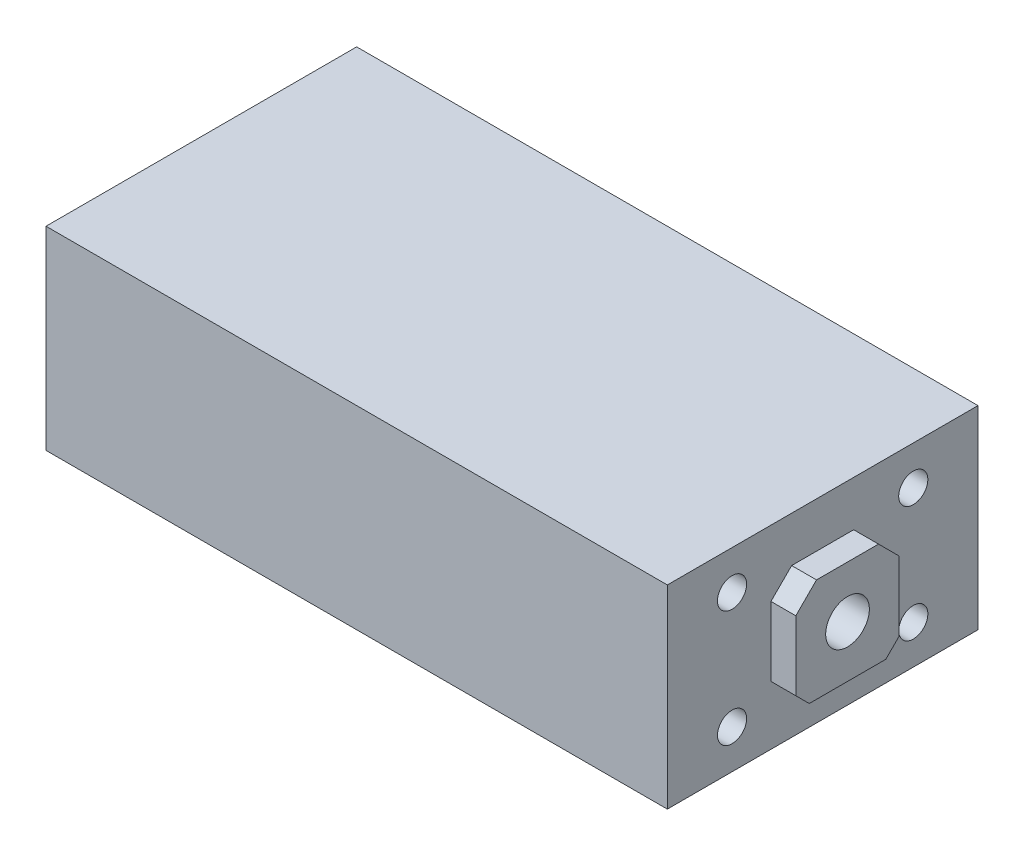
ISO-10303-21;
HEADER;
FILE_DESCRIPTION(('STEP AP214'),'2;1');
FILE_NAME('part.step','',(''),(''),'','','');
FILE_SCHEMA(('AUTOMOTIVE_DESIGN { 1 0 10303 214 1 1 1 1 }'));
ENDSEC;
DATA;
#1=APPLICATION_CONTEXT('core data for automotive mechanical design processes');
#2=APPLICATION_PROTOCOL_DEFINITION('international standard','automotive_design',2000,#1);
#3=PRODUCT_CONTEXT('',#1,'mechanical');
#4=PRODUCT('Part','Part','',(#3));
#5=PRODUCT_RELATED_PRODUCT_CATEGORY('part','',(#4));
#6=PRODUCT_DEFINITION_FORMATION('','',#4);
#7=PRODUCT_DEFINITION_CONTEXT('part definition',#1,'design');
#8=PRODUCT_DEFINITION('design','',#6,#7);
#9=PRODUCT_DEFINITION_SHAPE('','',#8);
#10=(LENGTH_UNIT() NAMED_UNIT(*) SI_UNIT(.MILLI.,.METRE.));
#11=(NAMED_UNIT(*) PLANE_ANGLE_UNIT() SI_UNIT($,.RADIAN.));
#12=(NAMED_UNIT(*) SI_UNIT($,.STERADIAN.) SOLID_ANGLE_UNIT());
#13=UNCERTAINTY_MEASURE_WITH_UNIT(LENGTH_MEASURE(1.E-05),#10,'distance_accuracy_value','');
#14=(GEOMETRIC_REPRESENTATION_CONTEXT(3) GLOBAL_UNCERTAINTY_ASSIGNED_CONTEXT((#13)) GLOBAL_UNIT_ASSIGNED_CONTEXT((#10,
#11,#12)) REPRESENTATION_CONTEXT('',''));
#15=CARTESIAN_POINT('',(0.,0.,0.));
#16=DIRECTION('',(0.,0.,1.));
#17=DIRECTION('',(1.,0.,0.));
#18=AXIS2_PLACEMENT_3D('',#15,#16,#17);
#19=CARTESIAN_POINT('',(0.,23.8125,-38.1));
#20=DIRECTION('',(-1.,0.,0.));
#21=DIRECTION('',(0.,0.,1.));
#22=AXIS2_PLACEMENT_3D('',#19,#20,#21);
#23=PLANE('',#22);
#24=CARTESIAN_POINT('',(0.,14.2748,22.225));
#25=DIRECTION('',(1.,0.,0.));
#26=DIRECTION('',(0.,0.,-1.));
#27=AXIS2_PLACEMENT_3D('',#24,#25,#26);
#28=CIRCLE('',#27,3.57187499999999);
#29=CARTESIAN_POINT('',(0.,14.2748,18.653125));
#30=VERTEX_POINT('',#29);
#31=EDGE_CURVE('E144',#30,#30,#28,.T.);
#32=ORIENTED_EDGE('',*,*,#31,.F.);
#33=EDGE_LOOP('',(#32));
#34=FACE_BOUND('',#33,.T.);
#35=CARTESIAN_POINT('',(0.,-14.2748,22.225));
#36=DIRECTION('',(1.,0.,0.));
#37=DIRECTION('',(0.,0.,-1.));
#38=AXIS2_PLACEMENT_3D('',#35,#36,#37);
#39=CIRCLE('',#38,3.57187499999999);
#40=CARTESIAN_POINT('',(0.,-14.2748,18.653125));
#41=VERTEX_POINT('',#40);
#42=EDGE_CURVE('E155',#41,#41,#39,.T.);
#43=ORIENTED_EDGE('',*,*,#42,.F.);
#44=EDGE_LOOP('',(#43));
#45=FACE_BOUND('',#44,.T.);
#46=CARTESIAN_POINT('',(0.,-14.2748,-22.225));
#47=DIRECTION('',(1.,0.,0.));
#48=DIRECTION('',(0.,0.,-1.));
#49=AXIS2_PLACEMENT_3D('',#46,#47,#48);
#50=CIRCLE('',#49,3.57187499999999);
#51=CARTESIAN_POINT('',(0.,-14.2748,-25.796875));
#52=VERTEX_POINT('',#51);
#53=EDGE_CURVE('E161',#52,#52,#50,.T.);
#54=ORIENTED_EDGE('',*,*,#53,.F.);
#55=EDGE_LOOP('',(#54));
#56=FACE_BOUND('',#55,.T.);
#57=CARTESIAN_POINT('',(0.,14.2748,-22.225));
#58=DIRECTION('',(1.,0.,0.));
#59=DIRECTION('',(0.,0.,-1.));
#60=AXIS2_PLACEMENT_3D('',#57,#58,#59);
#61=CIRCLE('',#60,3.57187499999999);
#62=CARTESIAN_POINT('',(0.,14.2748,-25.796875));
#63=VERTEX_POINT('',#62);
#64=EDGE_CURVE('E167',#63,#63,#61,.T.);
#65=ORIENTED_EDGE('',*,*,#64,.F.);
#66=EDGE_LOOP('',(#65));
#67=FACE_BOUND('',#66,.T.);
#68=DIRECTION('',(0.,1.,0.));
#69=VECTOR('',#68,1.);
#70=CARTESIAN_POINT('',(0.,-23.8125,-38.1));
#71=LINE('',#70,#69);
#72=CARTESIAN_POINT('',(0.,-23.8125,-38.1));
#73=VERTEX_POINT('',#72);
#74=CARTESIAN_POINT('',(0.,23.8125,-38.1));
#75=VERTEX_POINT('',#74);
#76=EDGE_CURVE('E234',#73,#75,#71,.T.);
#77=ORIENTED_EDGE('',*,*,#76,.T.);
#78=DIRECTION('',(0.,0.,1.));
#79=VECTOR('',#78,1.);
#80=CARTESIAN_POINT('',(0.,23.8125,38.1));
#81=LINE('',#80,#79);
#82=CARTESIAN_POINT('',(0.,23.8125,38.1));
#83=VERTEX_POINT('',#82);
#84=EDGE_CURVE('E250',#75,#83,#81,.T.);
#85=ORIENTED_EDGE('',*,*,#84,.T.);
#86=DIRECTION('',(0.,-1.,0.));
#87=VECTOR('',#86,1.);
#88=CARTESIAN_POINT('',(0.,-23.8125,38.1));
#89=LINE('',#88,#87);
#90=CARTESIAN_POINT('',(0.,-23.8125,38.1));
#91=VERTEX_POINT('',#90);
#92=EDGE_CURVE('E253',#83,#91,#89,.T.);
#93=ORIENTED_EDGE('',*,*,#92,.T.);
#94=DIRECTION('',(0.,0.,-1.));
#95=VECTOR('',#94,1.);
#96=CARTESIAN_POINT('',(0.,-23.8125,38.1));
#97=LINE('',#96,#95);
#98=EDGE_CURVE('E239',#91,#73,#97,.T.);
#99=ORIENTED_EDGE('',*,*,#98,.T.);
#100=EDGE_LOOP('',(#77,#85,#93,#99));
#101=FACE_BOUND('',#100,.T.);
#102=DIRECTION('',(0.,-0.707106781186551,-0.707106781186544));
#103=VECTOR('',#102,1.);
#104=CARTESIAN_POINT('',(0.,-9.38275999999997,12.68476));
#105=LINE('',#104,#103);
#106=CARTESIAN_POINT('',(0.,-9.38275999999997,12.68476));
#107=VERTEX_POINT('',#106);
#108=CARTESIAN_POINT('',(0.,-12.68476,9.38276));
#109=VERTEX_POINT('',#108);
#110=EDGE_CURVE('E173',#107,#109,#105,.T.);
#111=ORIENTED_EDGE('',*,*,#110,.F.);
#112=DIRECTION('',(0.,-1.,0.));
#113=VECTOR('',#112,1.);
#114=CARTESIAN_POINT('',(0.,0.,12.68476));
#115=LINE('',#114,#113);
#116=CARTESIAN_POINT('',(0.,7.60476000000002,12.68476));
#117=VERTEX_POINT('',#116);
#118=EDGE_CURVE('E178',#117,#107,#115,.T.);
#119=ORIENTED_EDGE('',*,*,#118,.F.);
#120=DIRECTION('',(0.,-0.707106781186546,0.707106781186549));
#121=VECTOR('',#120,1.);
#122=CARTESIAN_POINT('',(0.,7.60476000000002,12.68476));
#123=LINE('',#122,#121);
#124=CARTESIAN_POINT('',(0.,12.68476,7.60476));
#125=VERTEX_POINT('',#124);
#126=EDGE_CURVE('E206',#125,#117,#123,.T.);
#127=ORIENTED_EDGE('',*,*,#126,.F.);
#128=DIRECTION('',(0.,0.,1.));
#129=VECTOR('',#128,1.);
#130=CARTESIAN_POINT('',(0.,12.68476,7.60476));
#131=LINE('',#130,#129);
#132=CARTESIAN_POINT('',(0.,12.68476,-7.60476));
#133=VERTEX_POINT('',#132);
#134=EDGE_CURVE('E203',#133,#125,#131,.T.);
#135=ORIENTED_EDGE('',*,*,#134,.F.);
#136=DIRECTION('',(0.,0.707106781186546,0.707106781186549));
#137=VECTOR('',#136,1.);
#138=CARTESIAN_POINT('',(0.,7.60476000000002,-12.68476));
#139=LINE('',#138,#137);
#140=CARTESIAN_POINT('',(0.,7.60476000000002,-12.68476));
#141=VERTEX_POINT('',#140);
#142=EDGE_CURVE('E200',#141,#133,#139,.T.);
#143=ORIENTED_EDGE('',*,*,#142,.F.);
#144=DIRECTION('',(0.,1.,0.));
#145=VECTOR('',#144,1.);
#146=CARTESIAN_POINT('',(0.,0.,-12.68476));
#147=LINE('',#146,#145);
#148=CARTESIAN_POINT('',(0.,-9.38275999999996,-12.68476));
#149=VERTEX_POINT('',#148);
#150=EDGE_CURVE('E197',#149,#141,#147,.T.);
#151=ORIENTED_EDGE('',*,*,#150,.F.);
#152=DIRECTION('',(0.,0.707106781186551,-0.707106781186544));
#153=VECTOR('',#152,1.);
#154=CARTESIAN_POINT('',(0.,-9.38275999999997,-12.68476));
#155=LINE('',#154,#153);
#156=CARTESIAN_POINT('',(0.,-12.68476,-9.38276));
#157=VERTEX_POINT('',#156);
#158=EDGE_CURVE('E55',#157,#149,#155,.T.);
#159=ORIENTED_EDGE('',*,*,#158,.F.);
#160=DIRECTION('',(0.,0.,-1.));
#161=VECTOR('',#160,1.);
#162=CARTESIAN_POINT('',(0.,-12.68476,9.38276));
#163=LINE('',#162,#161);
#164=EDGE_CURVE('E50',#109,#157,#163,.T.);
#165=ORIENTED_EDGE('',*,*,#164,.F.);
#166=EDGE_LOOP('',(#111,#119,#127,#135,#143,#151,#159,#165));
#167=FACE_BOUND('',#166,.T.);
#168=ADVANCED_FACE('F33',(#34,#45,#56,#67,#101,#167),#23,.F.);
#169=CARTESIAN_POINT('',(-152.4,-23.8125,-38.1));
#170=DIRECTION('',(0.,0.,-1.));
#171=DIRECTION('',(-1.,0.,0.));
#172=AXIS2_PLACEMENT_3D('',#169,#170,#171);
#173=PLANE('',#172);
#174=ORIENTED_EDGE('',*,*,#76,.F.);
#175=DIRECTION('',(1.,0.,0.));
#176=VECTOR('',#175,1.);
#177=CARTESIAN_POINT('',(-152.4,-23.8125,-38.1));
#178=LINE('',#177,#176);
#179=CARTESIAN_POINT('',(-152.4,-23.8125,-38.1));
#180=VERTEX_POINT('',#179);
#181=EDGE_CURVE('E11',#180,#73,#178,.T.);
#182=ORIENTED_EDGE('',*,*,#181,.F.);
#183=DIRECTION('',(0.,1.,0.));
#184=VECTOR('',#183,1.);
#185=CARTESIAN_POINT('',(-152.4,-23.8125,-38.1));
#186=LINE('',#185,#184);
#187=CARTESIAN_POINT('',(-152.4,23.8125,-38.1));
#188=VERTEX_POINT('',#187);
#189=EDGE_CURVE('E235',#180,#188,#186,.T.);
#190=ORIENTED_EDGE('',*,*,#189,.T.);
#191=DIRECTION('',(1.,0.,0.));
#192=VECTOR('',#191,1.);
#193=CARTESIAN_POINT('',(-152.4,23.8125,-38.1));
#194=LINE('',#193,#192);
#195=EDGE_CURVE('E37',#188,#75,#194,.T.);
#196=ORIENTED_EDGE('',*,*,#195,.T.);
#197=EDGE_LOOP('',(#174,#182,#190,#196));
#198=FACE_BOUND('',#197,.T.);
#199=ADVANCED_FACE('F35',(#198),#173,.T.);
#200=CARTESIAN_POINT('',(-152.4,-23.8125,38.1));
#201=DIRECTION('',(0.,-1.,0.));
#202=DIRECTION('',(0.,0.,-1.));
#203=AXIS2_PLACEMENT_3D('',#200,#201,#202);
#204=PLANE('',#203);
#205=ORIENTED_EDGE('',*,*,#98,.F.);
#206=DIRECTION('',(1.,0.,0.));
#207=VECTOR('',#206,1.);
#208=CARTESIAN_POINT('',(-152.4,-23.8125,38.1));
#209=LINE('',#208,#207);
#210=CARTESIAN_POINT('',(-152.4,-23.8125,38.1));
#211=VERTEX_POINT('',#210);
#212=EDGE_CURVE('E42',#211,#91,#209,.T.);
#213=ORIENTED_EDGE('',*,*,#212,.F.);
#214=DIRECTION('',(0.,0.,-1.));
#215=VECTOR('',#214,1.);
#216=CARTESIAN_POINT('',(-152.4,-23.8125,38.1));
#217=LINE('',#216,#215);
#218=EDGE_CURVE('E245',#211,#180,#217,.T.);
#219=ORIENTED_EDGE('',*,*,#218,.T.);
#220=ORIENTED_EDGE('',*,*,#181,.T.);
#221=EDGE_LOOP('',(#205,#213,#219,#220));
#222=FACE_BOUND('',#221,.T.);
#223=ADVANCED_FACE('F270',(#222),#204,.T.);
#224=CARTESIAN_POINT('',(-152.4,-23.8125,38.1));
#225=DIRECTION('',(0.,0.,1.));
#226=DIRECTION('',(1.,0.,0.));
#227=AXIS2_PLACEMENT_3D('',#224,#225,#226);
#228=PLANE('',#227);
#229=ORIENTED_EDGE('',*,*,#92,.F.);
#230=DIRECTION('',(1.,0.,0.));
#231=VECTOR('',#230,1.);
#232=CARTESIAN_POINT('',(-152.4,23.8125,38.1));
#233=LINE('',#232,#231);
#234=CARTESIAN_POINT('',(-152.4,23.8125,38.1));
#235=VERTEX_POINT('',#234);
#236=EDGE_CURVE('E258',#235,#83,#233,.T.);
#237=ORIENTED_EDGE('',*,*,#236,.F.);
#238=DIRECTION('',(0.,-1.,0.));
#239=VECTOR('',#238,1.);
#240=CARTESIAN_POINT('',(-152.4,-23.8125,38.1));
#241=LINE('',#240,#239);
#242=EDGE_CURVE('E242',#235,#211,#241,.T.);
#243=ORIENTED_EDGE('',*,*,#242,.T.);
#244=ORIENTED_EDGE('',*,*,#212,.T.);
#245=EDGE_LOOP('',(#229,#237,#243,#244));
#246=FACE_BOUND('',#245,.T.);
#247=ADVANCED_FACE('F276',(#246),#228,.T.);
#248=CARTESIAN_POINT('',(-152.4,23.8125,38.1));
#249=DIRECTION('',(0.,1.,0.));
#250=DIRECTION('',(0.,0.,1.));
#251=AXIS2_PLACEMENT_3D('',#248,#249,#250);
#252=PLANE('',#251);
#253=ORIENTED_EDGE('',*,*,#84,.F.);
#254=ORIENTED_EDGE('',*,*,#195,.F.);
#255=DIRECTION('',(0.,0.,1.));
#256=VECTOR('',#255,1.);
#257=CARTESIAN_POINT('',(-152.4,23.8125,38.1));
#258=LINE('',#257,#256);
#259=EDGE_CURVE('E238',#188,#235,#258,.T.);
#260=ORIENTED_EDGE('',*,*,#259,.T.);
#261=ORIENTED_EDGE('',*,*,#236,.T.);
#262=EDGE_LOOP('',(#253,#254,#260,#261));
#263=FACE_BOUND('',#262,.T.);
#264=ADVANCED_FACE('F266',(#263),#252,.T.);
#265=CARTESIAN_POINT('',(-152.4,23.8125,-38.1));
#266=DIRECTION('',(-1.,0.,0.));
#267=DIRECTION('',(0.,0.,1.));
#268=AXIS2_PLACEMENT_3D('',#265,#266,#267);
#269=PLANE('',#268);
#270=ORIENTED_EDGE('',*,*,#189,.F.);
#271=ORIENTED_EDGE('',*,*,#218,.F.);
#272=ORIENTED_EDGE('',*,*,#242,.F.);
#273=ORIENTED_EDGE('',*,*,#259,.F.);
#274=EDGE_LOOP('',(#270,#271,#272,#273));
#275=FACE_BOUND('',#274,.T.);
#276=ADVANCED_FACE('F273',(#275),#269,.T.);
#277=CARTESIAN_POINT('',(6.096,-9.38275999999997,12.68476));
#278=DIRECTION('',(0.,0.707106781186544,-0.707106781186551));
#279=DIRECTION('',(0.,0.707106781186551,0.707106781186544));
#280=AXIS2_PLACEMENT_3D('',#277,#278,#279);
#281=PLANE('',#280);
#282=ORIENTED_EDGE('',*,*,#110,.T.);
#283=DIRECTION('',(-1.,0.,0.));
#284=VECTOR('',#283,1.);
#285=CARTESIAN_POINT('',(6.096,-12.68476,9.38276));
#286=LINE('',#285,#284);
#287=CARTESIAN_POINT('',(6.096,-12.68476,9.38276));
#288=VERTEX_POINT('',#287);
#289=EDGE_CURVE('E228',#288,#109,#286,.T.);
#290=ORIENTED_EDGE('',*,*,#289,.F.);
#291=DIRECTION('',(0.,-0.707106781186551,-0.707106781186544));
#292=VECTOR('',#291,1.);
#293=CARTESIAN_POINT('',(6.096,-9.38275999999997,12.68476));
#294=LINE('',#293,#292);
#295=CARTESIAN_POINT('',(6.096,-9.38275999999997,12.68476));
#296=VERTEX_POINT('',#295);
#297=EDGE_CURVE('E177',#296,#288,#294,.T.);
#298=ORIENTED_EDGE('',*,*,#297,.F.);
#299=DIRECTION('',(-1.,0.,0.));
#300=VECTOR('',#299,1.);
#301=CARTESIAN_POINT('',(6.096,-9.38275999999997,12.68476));
#302=LINE('',#301,#300);
#303=EDGE_CURVE('E231',#296,#107,#302,.T.);
#304=ORIENTED_EDGE('',*,*,#303,.T.);
#305=EDGE_LOOP('',(#282,#290,#298,#304));
#306=FACE_BOUND('',#305,.T.);
#307=ADVANCED_FACE('F295',(#306),#281,.F.);
#308=CARTESIAN_POINT('',(6.096,-12.68476,9.38276));
#309=DIRECTION('',(0.,1.,0.));
#310=DIRECTION('',(0.,0.,1.));
#311=AXIS2_PLACEMENT_3D('',#308,#309,#310);
#312=PLANE('',#311);
#313=ORIENTED_EDGE('',*,*,#164,.T.);
#314=DIRECTION('',(-1.,0.,0.));
#315=VECTOR('',#314,1.);
#316=CARTESIAN_POINT('',(6.096,-12.68476,-9.38276));
#317=LINE('',#316,#315);
#318=CARTESIAN_POINT('',(6.096,-12.68476,-9.38276));
#319=VERTEX_POINT('',#318);
#320=EDGE_CURVE('E225',#319,#157,#317,.T.);
#321=ORIENTED_EDGE('',*,*,#320,.F.);
#322=DIRECTION('',(0.,0.,-1.));
#323=VECTOR('',#322,1.);
#324=CARTESIAN_POINT('',(6.096,-12.68476,9.38276));
#325=LINE('',#324,#323);
#326=EDGE_CURVE('E180',#288,#319,#325,.T.);
#327=ORIENTED_EDGE('',*,*,#326,.F.);
#328=ORIENTED_EDGE('',*,*,#289,.T.);
#329=EDGE_LOOP('',(#313,#321,#327,#328));
#330=FACE_BOUND('',#329,.T.);
#331=ADVANCED_FACE('F298',(#330),#312,.F.);
#332=CARTESIAN_POINT('',(6.096,-9.38275999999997,-12.68476));
#333=DIRECTION('',(0.,0.707106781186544,0.707106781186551));
#334=DIRECTION('',(0.,-0.707106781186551,0.707106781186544));
#335=AXIS2_PLACEMENT_3D('',#332,#333,#334);
#336=PLANE('',#335);
#337=ORIENTED_EDGE('',*,*,#158,.T.);
#338=DIRECTION('',(-1.,0.,0.));
#339=VECTOR('',#338,1.);
#340=CARTESIAN_POINT('',(6.096,-9.38275999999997,-12.68476));
#341=LINE('',#340,#339);
#342=CARTESIAN_POINT('',(6.096,-9.38275999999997,-12.68476));
#343=VERTEX_POINT('',#342);
#344=EDGE_CURVE('E222',#343,#149,#341,.T.);
#345=ORIENTED_EDGE('',*,*,#344,.F.);
#346=DIRECTION('',(0.,0.707106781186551,-0.707106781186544));
#347=VECTOR('',#346,1.);
#348=CARTESIAN_POINT('',(6.096,-9.38275999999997,-12.68476));
#349=LINE('',#348,#347);
#350=EDGE_CURVE('E182',#319,#343,#349,.T.);
#351=ORIENTED_EDGE('',*,*,#350,.F.);
#352=ORIENTED_EDGE('',*,*,#320,.T.);
#353=EDGE_LOOP('',(#337,#345,#351,#352));
#354=FACE_BOUND('',#353,.T.);
#355=ADVANCED_FACE('F302',(#354),#336,.F.);
#356=CARTESIAN_POINT('',(6.096,0.,-12.68476));
#357=DIRECTION('',(0.,0.,1.));
#358=DIRECTION('',(1.,0.,0.));
#359=AXIS2_PLACEMENT_3D('',#356,#357,#358);
#360=PLANE('',#359);
#361=ORIENTED_EDGE('',*,*,#150,.T.);
#362=DIRECTION('',(-1.,0.,0.));
#363=VECTOR('',#362,1.);
#364=CARTESIAN_POINT('',(6.096,7.60476000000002,-12.68476));
#365=LINE('',#364,#363);
#366=CARTESIAN_POINT('',(6.096,7.60476000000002,-12.68476));
#367=VERTEX_POINT('',#366);
#368=EDGE_CURVE('E219',#367,#141,#365,.T.);
#369=ORIENTED_EDGE('',*,*,#368,.F.);
#370=DIRECTION('',(0.,1.,0.));
#371=VECTOR('',#370,1.);
#372=CARTESIAN_POINT('',(6.096,0.,-12.68476));
#373=LINE('',#372,#371);
#374=EDGE_CURVE('E184',#343,#367,#373,.T.);
#375=ORIENTED_EDGE('',*,*,#374,.F.);
#376=ORIENTED_EDGE('',*,*,#344,.T.);
#377=EDGE_LOOP('',(#361,#369,#375,#376));
#378=FACE_BOUND('',#377,.T.);
#379=ADVANCED_FACE('F306',(#378),#360,.F.);
#380=CARTESIAN_POINT('',(6.096,7.60476000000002,-12.68476));
#381=DIRECTION('',(0.,-0.707106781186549,0.707106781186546));
#382=DIRECTION('',(0.,-0.707106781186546,-0.707106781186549));
#383=AXIS2_PLACEMENT_3D('',#380,#381,#382);
#384=PLANE('',#383);
#385=ORIENTED_EDGE('',*,*,#142,.T.);
#386=DIRECTION('',(-1.,0.,0.));
#387=VECTOR('',#386,1.);
#388=CARTESIAN_POINT('',(6.096,12.68476,-7.60476));
#389=LINE('',#388,#387);
#390=CARTESIAN_POINT('',(6.096,12.68476,-7.60476));
#391=VERTEX_POINT('',#390);
#392=EDGE_CURVE('E216',#391,#133,#389,.T.);
#393=ORIENTED_EDGE('',*,*,#392,.F.);
#394=DIRECTION('',(0.,0.707106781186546,0.707106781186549));
#395=VECTOR('',#394,1.);
#396=CARTESIAN_POINT('',(6.096,7.60476000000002,-12.68476));
#397=LINE('',#396,#395);
#398=EDGE_CURVE('E186',#367,#391,#397,.T.);
#399=ORIENTED_EDGE('',*,*,#398,.F.);
#400=ORIENTED_EDGE('',*,*,#368,.T.);
#401=EDGE_LOOP('',(#385,#393,#399,#400));
#402=FACE_BOUND('',#401,.T.);
#403=ADVANCED_FACE('F310',(#402),#384,.F.);
#404=CARTESIAN_POINT('',(6.096,12.68476,7.60476));
#405=DIRECTION('',(0.,-1.,0.));
#406=DIRECTION('',(0.,0.,-1.));
#407=AXIS2_PLACEMENT_3D('',#404,#405,#406);
#408=PLANE('',#407);
#409=ORIENTED_EDGE('',*,*,#134,.T.);
#410=DIRECTION('',(-1.,0.,0.));
#411=VECTOR('',#410,1.);
#412=CARTESIAN_POINT('',(6.096,12.68476,7.60476));
#413=LINE('',#412,#411);
#414=CARTESIAN_POINT('',(6.096,12.68476,7.60476));
#415=VERTEX_POINT('',#414);
#416=EDGE_CURVE('E213',#415,#125,#413,.T.);
#417=ORIENTED_EDGE('',*,*,#416,.F.);
#418=DIRECTION('',(0.,0.,1.));
#419=VECTOR('',#418,1.);
#420=CARTESIAN_POINT('',(6.096,12.68476,7.60476));
#421=LINE('',#420,#419);
#422=EDGE_CURVE('E188',#391,#415,#421,.T.);
#423=ORIENTED_EDGE('',*,*,#422,.F.);
#424=ORIENTED_EDGE('',*,*,#392,.T.);
#425=EDGE_LOOP('',(#409,#417,#423,#424));
#426=FACE_BOUND('',#425,.T.);
#427=ADVANCED_FACE('F314',(#426),#408,.F.);
#428=CARTESIAN_POINT('',(6.096,7.60476000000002,12.68476));
#429=DIRECTION('',(0.,-0.707106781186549,-0.707106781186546));
#430=DIRECTION('',(0.,0.707106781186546,-0.707106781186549));
#431=AXIS2_PLACEMENT_3D('',#428,#429,#430);
#432=PLANE('',#431);
#433=ORIENTED_EDGE('',*,*,#126,.T.);
#434=DIRECTION('',(-1.,0.,0.));
#435=VECTOR('',#434,1.);
#436=CARTESIAN_POINT('',(6.096,7.60476000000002,12.68476));
#437=LINE('',#436,#435);
#438=CARTESIAN_POINT('',(6.096,7.60476000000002,12.68476));
#439=VERTEX_POINT('',#438);
#440=EDGE_CURVE('E193',#439,#117,#437,.T.);
#441=ORIENTED_EDGE('',*,*,#440,.F.);
#442=DIRECTION('',(0.,-0.707106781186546,0.707106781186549));
#443=VECTOR('',#442,1.);
#444=CARTESIAN_POINT('',(6.096,7.60476000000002,12.68476));
#445=LINE('',#444,#443);
#446=EDGE_CURVE('E190',#415,#439,#445,.T.);
#447=ORIENTED_EDGE('',*,*,#446,.F.);
#448=ORIENTED_EDGE('',*,*,#416,.T.);
#449=EDGE_LOOP('',(#433,#441,#447,#448));
#450=FACE_BOUND('',#449,.T.);
#451=ADVANCED_FACE('F318',(#450),#432,.F.);
#452=CARTESIAN_POINT('',(6.096,0.,12.68476));
#453=DIRECTION('',(0.,0.,-1.));
#454=DIRECTION('',(-1.,0.,0.));
#455=AXIS2_PLACEMENT_3D('',#452,#453,#454);
#456=PLANE('',#455);
#457=ORIENTED_EDGE('',*,*,#118,.T.);
#458=ORIENTED_EDGE('',*,*,#303,.F.);
#459=DIRECTION('',(0.,-1.,0.));
#460=VECTOR('',#459,1.);
#461=CARTESIAN_POINT('',(6.096,0.,12.68476));
#462=LINE('',#461,#460);
#463=EDGE_CURVE('E174',#439,#296,#462,.T.);
#464=ORIENTED_EDGE('',*,*,#463,.F.);
#465=ORIENTED_EDGE('',*,*,#440,.T.);
#466=EDGE_LOOP('',(#457,#458,#464,#465));
#467=FACE_BOUND('',#466,.T.);
#468=ADVANCED_FACE('F322',(#467),#456,.F.);
#469=CARTESIAN_POINT('',(6.096,-12.68476,12.68476));
#470=DIRECTION('',(1.,0.,0.));
#471=DIRECTION('',(0.,0.,-1.));
#472=AXIS2_PLACEMENT_3D('',#469,#470,#471);
#473=PLANE('',#472);
#474=CARTESIAN_POINT('',(6.096,0.,0.));
#475=DIRECTION('',(1.,0.,0.));
#476=DIRECTION('',(0.,0.,-1.));
#477=AXIS2_PLACEMENT_3D('',#474,#475,#476);
#478=CIRCLE('',#477,5.357876);
#479=CARTESIAN_POINT('',(6.096,0.,-5.357876));
#480=VERTEX_POINT('',#479);
#481=EDGE_CURVE('E145',#480,#480,#478,.T.);
#482=ORIENTED_EDGE('',*,*,#481,.F.);
#483=EDGE_LOOP('',(#482));
#484=FACE_BOUND('',#483,.T.);
#485=ORIENTED_EDGE('',*,*,#463,.T.);
#486=ORIENTED_EDGE('',*,*,#297,.T.);
#487=ORIENTED_EDGE('',*,*,#326,.T.);
#488=ORIENTED_EDGE('',*,*,#350,.T.);
#489=ORIENTED_EDGE('',*,*,#374,.T.);
#490=ORIENTED_EDGE('',*,*,#398,.T.);
#491=ORIENTED_EDGE('',*,*,#422,.T.);
#492=ORIENTED_EDGE('',*,*,#446,.T.);
#493=EDGE_LOOP('',(#485,#486,#487,#488,#489,#490,#491,#492));
#494=FACE_BOUND('',#493,.T.);
#495=ADVANCED_FACE('F326',(#484,#494),#473,.T.);
#496=CARTESIAN_POINT('',(-6.35,14.2748,-22.225));
#497=DIRECTION('',(1.,0.,0.));
#498=DIRECTION('',(0.,0.,-1.));
#499=AXIS2_PLACEMENT_3D('',#496,#497,#498);
#500=CONICAL_SURFACE('',#499,3.571875,1.02974425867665);
#501=CARTESIAN_POINT('',(-8.49619902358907,14.2748,-22.225));
#502=VERTEX_POINT('',#501);
#503=VERTEX_LOOP('',#502);
#504=FACE_BOUND('',#503,.T.);
#505=CARTESIAN_POINT('',(-6.35,14.2748,-22.225));
#506=DIRECTION('',(1.,0.,0.));
#507=DIRECTION('',(0.,0.,-1.));
#508=AXIS2_PLACEMENT_3D('',#505,#506,#507);
#509=CIRCLE('',#508,3.571875);
#510=CARTESIAN_POINT('',(-6.35,14.2748,-25.796875));
#511=VERTEX_POINT('',#510);
#512=EDGE_CURVE('E170',#511,#511,#509,.T.);
#513=ORIENTED_EDGE('',*,*,#512,.T.);
#514=EDGE_LOOP('',(#513));
#515=FACE_BOUND('',#514,.T.);
#516=ADVANCED_FACE('F330',(#504,#515),#500,.F.);
#517=CARTESIAN_POINT('',(0.,14.2748,-22.225));
#518=DIRECTION('',(1.,0.,0.));
#519=DIRECTION('',(0.,0.,-1.));
#520=AXIS2_PLACEMENT_3D('',#517,#518,#519);
#521=CYLINDRICAL_SURFACE('',#520,3.57187499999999);
#522=ORIENTED_EDGE('',*,*,#512,.F.);
#523=EDGE_LOOP('',(#522));
#524=FACE_BOUND('',#523,.T.);
#525=ORIENTED_EDGE('',*,*,#64,.T.);
#526=EDGE_LOOP('',(#525));
#527=FACE_BOUND('',#526,.T.);
#528=ADVANCED_FACE('F334',(#524,#527),#521,.F.);
#529=CARTESIAN_POINT('',(-6.35,-14.2748,-22.225));
#530=DIRECTION('',(1.,0.,0.));
#531=DIRECTION('',(0.,0.,-1.));
#532=AXIS2_PLACEMENT_3D('',#529,#530,#531);
#533=CONICAL_SURFACE('',#532,3.571875,1.02974425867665);
#534=CARTESIAN_POINT('',(-8.49619902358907,-14.2748,-22.225));
#535=VERTEX_POINT('',#534);
#536=VERTEX_LOOP('',#535);
#537=FACE_BOUND('',#536,.T.);
#538=CARTESIAN_POINT('',(-6.35,-14.2748,-22.225));
#539=DIRECTION('',(1.,0.,0.));
#540=DIRECTION('',(0.,0.,-1.));
#541=AXIS2_PLACEMENT_3D('',#538,#539,#540);
#542=CIRCLE('',#541,3.571875);
#543=CARTESIAN_POINT('',(-6.35,-14.2748,-25.796875));
#544=VERTEX_POINT('',#543);
#545=EDGE_CURVE('E164',#544,#544,#542,.T.);
#546=ORIENTED_EDGE('',*,*,#545,.T.);
#547=EDGE_LOOP('',(#546));
#548=FACE_BOUND('',#547,.T.);
#549=ADVANCED_FACE('F338',(#537,#548),#533,.F.);
#550=CARTESIAN_POINT('',(0.,-14.2748,-22.225));
#551=DIRECTION('',(1.,0.,0.));
#552=DIRECTION('',(0.,0.,-1.));
#553=AXIS2_PLACEMENT_3D('',#550,#551,#552);
#554=CYLINDRICAL_SURFACE('',#553,3.57187499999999);
#555=ORIENTED_EDGE('',*,*,#545,.F.);
#556=EDGE_LOOP('',(#555));
#557=FACE_BOUND('',#556,.T.);
#558=ORIENTED_EDGE('',*,*,#53,.T.);
#559=EDGE_LOOP('',(#558));
#560=FACE_BOUND('',#559,.T.);
#561=ADVANCED_FACE('F342',(#557,#560),#554,.F.);
#562=CARTESIAN_POINT('',(-6.35,-14.2748,22.225));
#563=DIRECTION('',(1.,0.,0.));
#564=DIRECTION('',(0.,0.,-1.));
#565=AXIS2_PLACEMENT_3D('',#562,#563,#564);
#566=CONICAL_SURFACE('',#565,3.571875,1.02974425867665);
#567=CARTESIAN_POINT('',(-8.49619902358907,-14.2748,22.225));
#568=VERTEX_POINT('',#567);
#569=VERTEX_LOOP('',#568);
#570=FACE_BOUND('',#569,.T.);
#571=CARTESIAN_POINT('',(-6.35,-14.2748,22.225));
#572=DIRECTION('',(1.,0.,0.));
#573=DIRECTION('',(0.,0.,-1.));
#574=AXIS2_PLACEMENT_3D('',#571,#572,#573);
#575=CIRCLE('',#574,3.571875);
#576=CARTESIAN_POINT('',(-6.35,-14.2748,18.653125));
#577=VERTEX_POINT('',#576);
#578=EDGE_CURVE('E158',#577,#577,#575,.T.);
#579=ORIENTED_EDGE('',*,*,#578,.T.);
#580=EDGE_LOOP('',(#579));
#581=FACE_BOUND('',#580,.T.);
#582=ADVANCED_FACE('F346',(#570,#581),#566,.F.);
#583=CARTESIAN_POINT('',(0.,-14.2748,22.225));
#584=DIRECTION('',(1.,0.,0.));
#585=DIRECTION('',(0.,0.,-1.));
#586=AXIS2_PLACEMENT_3D('',#583,#584,#585);
#587=CYLINDRICAL_SURFACE('',#586,3.57187499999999);
#588=ORIENTED_EDGE('',*,*,#578,.F.);
#589=EDGE_LOOP('',(#588));
#590=FACE_BOUND('',#589,.T.);
#591=ORIENTED_EDGE('',*,*,#42,.T.);
#592=EDGE_LOOP('',(#591));
#593=FACE_BOUND('',#592,.T.);
#594=ADVANCED_FACE('F350',(#590,#593),#587,.F.);
#595=CARTESIAN_POINT('',(-6.35,14.2748,22.225));
#596=DIRECTION('',(1.,0.,0.));
#597=DIRECTION('',(0.,0.,-1.));
#598=AXIS2_PLACEMENT_3D('',#595,#596,#597);
#599=CONICAL_SURFACE('',#598,3.571875,1.02974425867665);
#600=CARTESIAN_POINT('',(-8.49619902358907,14.2748,22.225));
#601=VERTEX_POINT('',#600);
#602=VERTEX_LOOP('',#601);
#603=FACE_BOUND('',#602,.T.);
#604=CARTESIAN_POINT('',(-6.35,14.2748,22.225));
#605=DIRECTION('',(1.,0.,0.));
#606=DIRECTION('',(0.,0.,-1.));
#607=AXIS2_PLACEMENT_3D('',#604,#605,#606);
#608=CIRCLE('',#607,3.571875);
#609=CARTESIAN_POINT('',(-6.35,14.2748,18.653125));
#610=VERTEX_POINT('',#609);
#611=EDGE_CURVE('E148',#610,#610,#608,.T.);
#612=ORIENTED_EDGE('',*,*,#611,.T.);
#613=EDGE_LOOP('',(#612));
#614=FACE_BOUND('',#613,.T.);
#615=ADVANCED_FACE('F354',(#603,#614),#599,.F.);
#616=CARTESIAN_POINT('',(0.,14.2748,22.225));
#617=DIRECTION('',(1.,0.,0.));
#618=DIRECTION('',(0.,0.,-1.));
#619=AXIS2_PLACEMENT_3D('',#616,#617,#618);
#620=CYLINDRICAL_SURFACE('',#619,3.571875);
#621=ORIENTED_EDGE('',*,*,#611,.F.);
#622=EDGE_LOOP('',(#621));
#623=FACE_BOUND('',#622,.T.);
#624=ORIENTED_EDGE('',*,*,#31,.T.);
#625=EDGE_LOOP('',(#624));
#626=FACE_BOUND('',#625,.T.);
#627=ADVANCED_FACE('F138',(#623,#626),#620,.F.);
#628=CARTESIAN_POINT('',(-16.129,0.,0.));
#629=DIRECTION('',(1.,0.,0.));
#630=DIRECTION('',(0.,0.,-1.));
#631=AXIS2_PLACEMENT_3D('',#628,#629,#630);
#632=CONICAL_SURFACE('',#631,5.357876,1.02974425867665);
#633=CARTESIAN_POINT('',(-19.3483366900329,0.,0.));
#634=VERTEX_POINT('',#633);
#635=VERTEX_LOOP('',#634);
#636=FACE_BOUND('',#635,.T.);
#637=CARTESIAN_POINT('',(-16.129,0.,0.));
#638=DIRECTION('',(1.,0.,0.));
#639=DIRECTION('',(0.,0.,-1.));
#640=AXIS2_PLACEMENT_3D('',#637,#638,#639);
#641=CIRCLE('',#640,5.357876);
#642=CARTESIAN_POINT('',(-16.129,0.,-5.357876));
#643=VERTEX_POINT('',#642);
#644=EDGE_CURVE('E142',#643,#643,#641,.T.);
#645=ORIENTED_EDGE('',*,*,#644,.T.);
#646=EDGE_LOOP('',(#645));
#647=FACE_BOUND('',#646,.T.);
#648=ADVANCED_FACE('F134',(#636,#647),#632,.F.);
#649=CARTESIAN_POINT('',(6.096,0.,0.));
#650=DIRECTION('',(1.,0.,0.));
#651=DIRECTION('',(0.,0.,-1.));
#652=AXIS2_PLACEMENT_3D('',#649,#650,#651);
#653=CYLINDRICAL_SURFACE('',#652,5.357876);
#654=ORIENTED_EDGE('',*,*,#644,.F.);
#655=EDGE_LOOP('',(#654));
#656=FACE_BOUND('',#655,.T.);
#657=ORIENTED_EDGE('',*,*,#481,.T.);
#658=EDGE_LOOP('',(#657));
#659=FACE_BOUND('',#658,.T.);
#660=ADVANCED_FACE('F137',(#656,#659),#653,.F.);
#661=CLOSED_SHELL('',(#168,#199,#223,#247,#264,#276,#307,#331,#355,#379,#403,#427,#451,#468,
#495,#516,#528,#549,#561,#582,#594,#615,#627,#648,#660));
#662=MANIFOLD_SOLID_BREP('B2',#661);
#663=ADVANCED_BREP_SHAPE_REPRESENTATION('',(#18,#662),#14);
#664=SHAPE_DEFINITION_REPRESENTATION(#9,#663);
ENDSEC;
END-ISO-10303-21;
